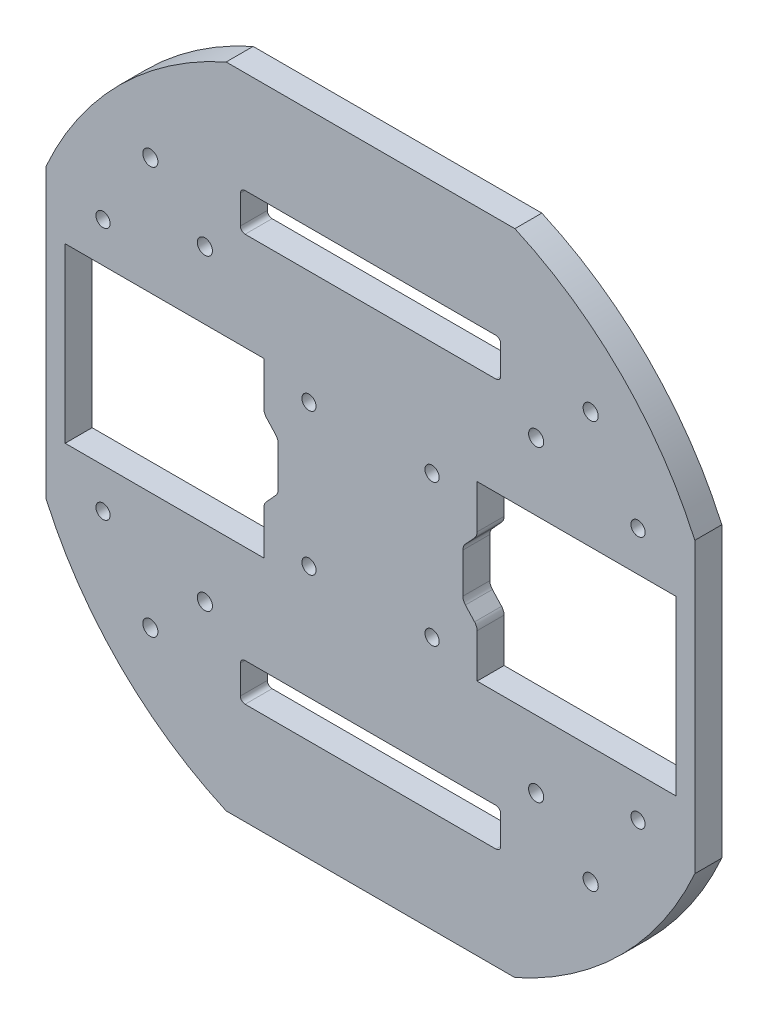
from build123d import *

# Parameters (mm, degrees)
SCHIZZO1_R                   = 75
ESTRUSIONE_ESTRUSIONE1_DEPTH = 5.7
TAGLIO_ESTRUSIONE1_DEPTH     = 107.219066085
RIPETIZIONECIRCOLARE1_COUNT  = 4
SCHIZZO4_R                   = 1.5
TAGLIO_ESTRUSIONE3_DEPTH     = 98.066935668
SCHIZZO5_W                   = 55
SCHIZZO5_H                   = 8
TAGLIO_ESTRUSIONE4_DEPTH     = 98.066935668
RACCORDO1_R                  = 1
SCHIZZO6_R                   = 1.5
TAGLIO_ESTRUSIONE5_DEPTH     = 98.066935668
TAGLIO_ESTRUSIONE6_DEPTH     = 98.066935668
RACCORDO2_R                  = 2
SCHIZZO8_R                   = 1.6
TAGLIO_ESTRUSIONE7_DEPTH     = 98.066935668
SCHIZZO9_R                   = 1.6
TAGLIO_ESTRUSIONE8_DEPTH     = 98.066935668


with BuildPart() as part:
    # Schizzo1 → Estrusione-Estrusione1 (new body)
    with BuildSketch(Plane.XY):
        Circle(SCHIZZO1_R)
    extrude(amount=ESTRUSIONE_ESTRUSIONE1_DEPTH)

    # Schizzo2 → Taglio-Estrusione1 (cut, through all)
    with BuildSketch(Plane.XY.offset(5.7)):
        with BuildLine():
            Line((-68.518245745, 30.5), (-68.518245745, -30.5))
            ThreePointArc((-68.518245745, -30.5), (-75, 0), (-68.518245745, 30.5))
        make_face()
    taglio_estrusione1 = extrude(amount=-TAGLIO_ESTRUSIONE1_DEPTH, mode=Mode.SUBTRACT)

    # RipetizioneCircolare1: Taglio-Estrusione1 ×4 about axis
    ripetizionecircolare1_axis = Axis((0, 0, 0), (0, 0, 1))
    for i in range(1, RIPETIZIONECIRCOLARE1_COUNT):
        add(taglio_estrusione1.rotate(ripetizionecircolare1_axis, i * 360 / RIPETIZIONECIRCOLARE1_COUNT), mode=Mode.SUBTRACT)

    # Schizzo4 → Taglio-Estrusione3 (cut, through all)
    with BuildSketch(Plane.XY.offset(5.7)):
        with Locations((-13, -15)):
            Circle(SCHIZZO4_R)
        with Locations((13, -15)):
            Circle(SCHIZZO4_R)
    taglio_estrusione3 = extrude(amount=-TAGLIO_ESTRUSIONE3_DEPTH, mode=Mode.SUBTRACT)

    # Schizzo5 → Taglio-Estrusione4 (cut, through all)
    with BuildSketch(Plane.XY.offset(5.7)):
        with Locations((0, -43)):
            Rectangle(SCHIZZO5_W, SCHIZZO5_H)
    taglio_estrusione4 = extrude(amount=-TAGLIO_ESTRUSIONE4_DEPTH, mode=Mode.SUBTRACT)

    # Specchia2: Taglio-Estrusione3, Taglio-Estrusione4 across plane
    add(taglio_estrusione3.mirror(Plane.ZX), mode=Mode.SUBTRACT)
    add(taglio_estrusione4.mirror(Plane.ZX), mode=Mode.SUBTRACT)

    # Raccordo1
    raccordo1_edges = [part.edges().sort_by_distance(p)[0] for p in [
        (27.5, -39, 2.85),
        (27.5, -47, 2.85),
        (-27.5, -47, 2.85),
        (-27.5, -39, 2.85),
        (27.5, 47, 2.85),
        (27.5, 39, 2.85),
        (-27.5, 39, 2.85),
        (-27.5, 47, 2.85),
    ]]
    fillet(raccordo1_edges, radius=RACCORDO1_R)

    # Schizzo6 → Taglio-Estrusione5 (cut, through all)
    with BuildSketch(Plane.XY.offset(5.7)):
        with Locations((-56.518245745, 26.7)):
            Circle(SCHIZZO6_R)
        with Locations((-56.518245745, -26.7)):
            Circle(SCHIZZO6_R)
    taglio_estrusione5 = extrude(amount=-TAGLIO_ESTRUSIONE5_DEPTH, mode=Mode.SUBTRACT)

    # Specchia3: Taglio-Estrusione5 across plane
    add(taglio_estrusione5.mirror(Plane(origin=(0, 0, 0), x_dir=(0, 0, 1), z_dir=(1, 0, 0))), mode=Mode.SUBTRACT)

    # Schizzo7 → Taglio-Estrusione6 (cut, through all)
    with BuildSketch(Plane.XY.offset(5.7)):
        Polygon((-64.518245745, 18.26), (-22.518245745, 18.26), (-22.518245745, 8.26), (-19.518245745, 5), (-19.518245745, -5), (-22.518245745, -8.26), (-22.518245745, -18.26), (-64.518245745, -18.26), align=None)
    taglio_estrusione6 = extrude(amount=-TAGLIO_ESTRUSIONE6_DEPTH, mode=Mode.SUBTRACT)

    # Specchia4: Taglio-Estrusione6 across plane
    add(taglio_estrusione6.mirror(Plane(origin=(0, 0, 0), x_dir=(0, 0, 1), z_dir=(1, 0, 0))), mode=Mode.SUBTRACT)

    # Raccordo2
    raccordo2_edges = [part.edges().sort_by_distance(p)[0] for p in [
        (-22.518245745, -8.26, 2.85),
        (-22.518245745, 8.26, 2.85),
        (-19.518245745, 5, 2.85),
        (-19.518245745, -5, 2.85),
        (22.518245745, -8.26, 2.85),
        (19.518245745, -5, 2.85),
        (19.518245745, 5, 2.85),
        (22.518245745, 8.26, 2.85),
    ]]
    fillet(raccordo2_edges, radius=RACCORDO2_R)

    # Schizzo8 → Taglio-Estrusione7 (cut, through all)
    with BuildSketch(Plane.XY.offset(5.7)):
        with Locations((-46.518245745, 43)):
            Circle(SCHIZZO8_R)
        with Locations(Location((46.518245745, 43, 0), (0, 0, 180))):
            Circle(SCHIZZO8_R)
        with Locations((46.518245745, -43)):
            Circle(SCHIZZO8_R)
        with Locations(Location((-46.518245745, -43, 0), (0, 0, 180))):
            Circle(SCHIZZO8_R)
    extrude(amount=-TAGLIO_ESTRUSIONE7_DEPTH, mode=Mode.SUBTRACT)

    # Schizzo9 → Taglio-Estrusione8 (cut, through all)
    with BuildSketch(Plane.XY.offset(5.7)):
        with Locations((-35, 32.5)):
            Circle(SCHIZZO9_R)
        with Locations((35, 32.5)):
            Circle(SCHIZZO9_R)
        with Locations((35, -32.5)):
            Circle(SCHIZZO9_R)
        with Locations((-35, -32.5)):
            Circle(SCHIZZO9_R)
    extrude(amount=-TAGLIO_ESTRUSIONE8_DEPTH, mode=Mode.SUBTRACT)


solid = part.part
